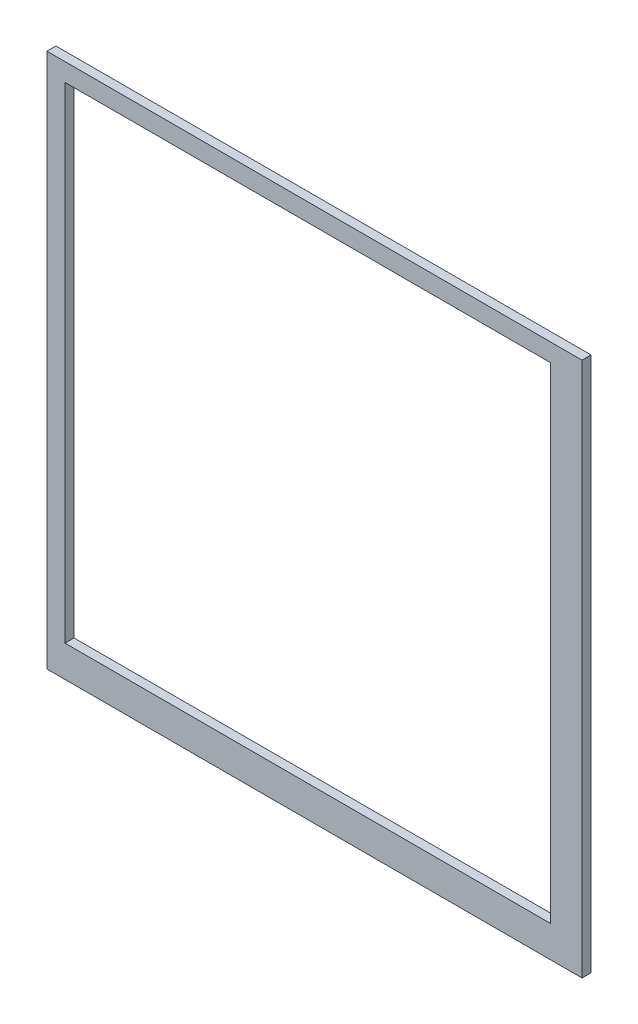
ISO-10303-21;
HEADER;
FILE_DESCRIPTION(('STEP AP214'),'2;1');
FILE_NAME('part.step','',(''),(''),'','','');
FILE_SCHEMA(('AUTOMOTIVE_DESIGN { 1 0 10303 214 1 1 1 1 }'));
ENDSEC;
DATA;
#1=APPLICATION_CONTEXT('core data for automotive mechanical design processes');
#2=APPLICATION_PROTOCOL_DEFINITION('international standard','automotive_design',2000,#1);
#3=PRODUCT_CONTEXT('',#1,'mechanical');
#4=PRODUCT('Part','Part','',(#3));
#5=PRODUCT_RELATED_PRODUCT_CATEGORY('part','',(#4));
#6=PRODUCT_DEFINITION_FORMATION('','',#4);
#7=PRODUCT_DEFINITION_CONTEXT('part definition',#1,'design');
#8=PRODUCT_DEFINITION('design','',#6,#7);
#9=PRODUCT_DEFINITION_SHAPE('','',#8);
#10=(LENGTH_UNIT() NAMED_UNIT(*) SI_UNIT(.MILLI.,.METRE.));
#11=(NAMED_UNIT(*) PLANE_ANGLE_UNIT() SI_UNIT($,.RADIAN.));
#12=(NAMED_UNIT(*) SI_UNIT($,.STERADIAN.) SOLID_ANGLE_UNIT());
#13=UNCERTAINTY_MEASURE_WITH_UNIT(LENGTH_MEASURE(1.E-05),#10,'distance_accuracy_value','');
#14=(GEOMETRIC_REPRESENTATION_CONTEXT(3) GLOBAL_UNCERTAINTY_ASSIGNED_CONTEXT((#13)) GLOBAL_UNIT_ASSIGNED_CONTEXT((#10,
#11,#12)) REPRESENTATION_CONTEXT('',''));
#15=CARTESIAN_POINT('',(0.,0.,0.));
#16=DIRECTION('',(0.,0.,1.));
#17=DIRECTION('',(1.,0.,0.));
#18=AXIS2_PLACEMENT_3D('',#15,#16,#17);
#19=CARTESIAN_POINT('',(0.,0.,10.));
#20=DIRECTION('',(0.,0.,1.));
#21=DIRECTION('',(1.,0.,0.));
#22=AXIS2_PLACEMENT_3D('',#19,#20,#21);
#23=PLANE('',#22);
#24=DIRECTION('',(0.,-1.,0.));
#25=VECTOR('',#24,1.);
#26=CARTESIAN_POINT('',(305.,-305.,10.));
#27=LINE('',#26,#25);
#28=CARTESIAN_POINT('',(305.,290.,10.));
#29=VERTEX_POINT('',#28);
#30=CARTESIAN_POINT('',(305.,-305.,10.));
#31=VERTEX_POINT('',#30);
#32=EDGE_CURVE('E115',#29,#31,#27,.T.);
#33=ORIENTED_EDGE('',*,*,#32,.F.);
#34=DIRECTION('',(-1.,0.,0.));
#35=VECTOR('',#34,1.);
#36=CARTESIAN_POINT('',(290.,290.,10.));
#37=LINE('',#36,#35);
#38=CARTESIAN_POINT('',(-290.,290.,10.));
#39=VERTEX_POINT('',#38);
#40=EDGE_CURVE('E156',#29,#39,#37,.T.);
#41=ORIENTED_EDGE('',*,*,#40,.T.);
#42=DIRECTION('',(0.,-1.,0.));
#43=VECTOR('',#42,1.);
#44=CARTESIAN_POINT('',(-290.,-290.,10.));
#45=LINE('',#44,#43);
#46=CARTESIAN_POINT('',(-290.,-305.,10.));
#47=VERTEX_POINT('',#46);
#48=EDGE_CURVE('E40',#39,#47,#45,.T.);
#49=ORIENTED_EDGE('',*,*,#48,.T.);
#50=DIRECTION('',(-1.,0.,0.));
#51=VECTOR('',#50,1.);
#52=CARTESIAN_POINT('',(-290.,-305.,10.));
#53=LINE('',#52,#51);
#54=EDGE_CURVE('E103',#31,#47,#53,.T.);
#55=ORIENTED_EDGE('',*,*,#54,.F.);
#56=EDGE_LOOP('',(#33,#41,#49,#55));
#57=FACE_BOUND('',#56,.T.);
#58=DIRECTION('',(1.,0.,0.));
#59=VECTOR('',#58,1.);
#60=CARTESIAN_POINT('',(270.,-270.,10.));
#61=LINE('',#60,#59);
#62=CARTESIAN_POINT('',(-270.,-270.,10.));
#63=VERTEX_POINT('',#62);
#64=CARTESIAN_POINT('',(270.,-270.,10.));
#65=VERTEX_POINT('',#64);
#66=EDGE_CURVE('E132',#63,#65,#61,.T.);
#67=ORIENTED_EDGE('',*,*,#66,.F.);
#68=DIRECTION('',(0.,-1.,0.));
#69=VECTOR('',#68,1.);
#70=CARTESIAN_POINT('',(-270.,-270.,10.));
#71=LINE('',#70,#69);
#72=CARTESIAN_POINT('',(-270.,270.,10.));
#73=VERTEX_POINT('',#72);
#74=EDGE_CURVE('E130',#73,#63,#71,.T.);
#75=ORIENTED_EDGE('',*,*,#74,.F.);
#76=DIRECTION('',(-1.,0.,0.));
#77=VECTOR('',#76,1.);
#78=CARTESIAN_POINT('',(270.,270.,10.));
#79=LINE('',#78,#77);
#80=CARTESIAN_POINT('',(270.,270.,10.));
#81=VERTEX_POINT('',#80);
#82=EDGE_CURVE('E137',#81,#73,#79,.T.);
#83=ORIENTED_EDGE('',*,*,#82,.F.);
#84=DIRECTION('',(0.,1.,0.));
#85=VECTOR('',#84,1.);
#86=CARTESIAN_POINT('',(270.,-270.,10.));
#87=LINE('',#86,#85);
#88=EDGE_CURVE('E135',#65,#81,#87,.T.);
#89=ORIENTED_EDGE('',*,*,#88,.F.);
#90=EDGE_LOOP('',(#67,#75,#83,#89));
#91=FACE_BOUND('',#90,.T.);
#92=ADVANCED_FACE('F32',(#57,#91),#23,.T.);
#93=CARTESIAN_POINT('',(0.,0.,0.));
#94=DIRECTION('',(0.,0.,1.));
#95=DIRECTION('',(1.,0.,0.));
#96=AXIS2_PLACEMENT_3D('',#93,#94,#95);
#97=PLANE('',#96);
#98=DIRECTION('',(-1.,0.,0.));
#99=VECTOR('',#98,1.);
#100=CARTESIAN_POINT('',(290.,290.,0.));
#101=LINE('',#100,#99);
#102=CARTESIAN_POINT('',(305.,290.,0.));
#103=VERTEX_POINT('',#102);
#104=CARTESIAN_POINT('',(-290.,290.,0.));
#105=VERTEX_POINT('',#104);
#106=EDGE_CURVE('E155',#103,#105,#101,.T.);
#107=ORIENTED_EDGE('',*,*,#106,.F.);
#108=DIRECTION('',(0.,-1.,0.));
#109=VECTOR('',#108,1.);
#110=CARTESIAN_POINT('',(305.,-305.,0.));
#111=LINE('',#110,#109);
#112=CARTESIAN_POINT('',(305.,-305.,0.));
#113=VERTEX_POINT('',#112);
#114=EDGE_CURVE('E124',#103,#113,#111,.T.);
#115=ORIENTED_EDGE('',*,*,#114,.T.);
#116=DIRECTION('',(-1.,0.,0.));
#117=VECTOR('',#116,1.);
#118=CARTESIAN_POINT('',(-290.,-305.,0.));
#119=LINE('',#118,#117);
#120=CARTESIAN_POINT('',(-290.,-305.,0.));
#121=VERTEX_POINT('',#120);
#122=EDGE_CURVE('E105',#113,#121,#119,.T.);
#123=ORIENTED_EDGE('',*,*,#122,.T.);
#124=DIRECTION('',(0.,-1.,0.));
#125=VECTOR('',#124,1.);
#126=CARTESIAN_POINT('',(-290.,-290.,0.));
#127=LINE('',#126,#125);
#128=EDGE_CURVE('E158',#105,#121,#127,.T.);
#129=ORIENTED_EDGE('',*,*,#128,.F.);
#130=EDGE_LOOP('',(#107,#115,#123,#129));
#131=FACE_BOUND('',#130,.T.);
#132=DIRECTION('',(0.,-1.,0.));
#133=VECTOR('',#132,1.);
#134=CARTESIAN_POINT('',(-270.,-270.,0.));
#135=LINE('',#134,#133);
#136=CARTESIAN_POINT('',(-270.,270.,0.));
#137=VERTEX_POINT('',#136);
#138=CARTESIAN_POINT('',(-270.,-270.,0.));
#139=VERTEX_POINT('',#138);
#140=EDGE_CURVE('E55',#137,#139,#135,.T.);
#141=ORIENTED_EDGE('',*,*,#140,.T.);
#142=DIRECTION('',(1.,0.,0.));
#143=VECTOR('',#142,1.);
#144=CARTESIAN_POINT('',(270.,-270.,0.));
#145=LINE('',#144,#143);
#146=CARTESIAN_POINT('',(270.,-270.,0.));
#147=VERTEX_POINT('',#146);
#148=EDGE_CURVE('E141',#139,#147,#145,.T.);
#149=ORIENTED_EDGE('',*,*,#148,.T.);
#150=DIRECTION('',(0.,1.,0.));
#151=VECTOR('',#150,1.);
#152=CARTESIAN_POINT('',(270.,-270.,0.));
#153=LINE('',#152,#151);
#154=CARTESIAN_POINT('',(270.,270.,0.));
#155=VERTEX_POINT('',#154);
#156=EDGE_CURVE('E144',#147,#155,#153,.T.);
#157=ORIENTED_EDGE('',*,*,#156,.T.);
#158=DIRECTION('',(-1.,0.,0.));
#159=VECTOR('',#158,1.);
#160=CARTESIAN_POINT('',(270.,270.,0.));
#161=LINE('',#160,#159);
#162=EDGE_CURVE('E133',#155,#137,#161,.T.);
#163=ORIENTED_EDGE('',*,*,#162,.T.);
#164=EDGE_LOOP('',(#141,#149,#157,#163));
#165=FACE_BOUND('',#164,.T.);
#166=ADVANCED_FACE('F165',(#131,#165),#97,.F.);
#167=CARTESIAN_POINT('',(290.,290.,10.));
#168=DIRECTION('',(0.,-1.,0.));
#169=DIRECTION('',(1.,0.,0.));
#170=AXIS2_PLACEMENT_3D('',#167,#168,#169);
#171=PLANE('',#170);
#172=ORIENTED_EDGE('',*,*,#106,.T.);
#173=DIRECTION('',(0.,0.,-1.));
#174=VECTOR('',#173,1.);
#175=CARTESIAN_POINT('',(-290.,290.,10.));
#176=LINE('',#175,#174);
#177=EDGE_CURVE('E11',#39,#105,#176,.T.);
#178=ORIENTED_EDGE('',*,*,#177,.F.);
#179=ORIENTED_EDGE('',*,*,#40,.F.);
#180=DIRECTION('',(0.,0.,-1.));
#181=VECTOR('',#180,1.);
#182=CARTESIAN_POINT('',(305.,290.,10.));
#183=LINE('',#182,#181);
#184=EDGE_CURVE('E122',#29,#103,#183,.T.);
#185=ORIENTED_EDGE('',*,*,#184,.T.);
#186=EDGE_LOOP('',(#172,#178,#179,#185));
#187=FACE_BOUND('',#186,.T.);
#188=ADVANCED_FACE('F34',(#187),#171,.F.);
#189=CARTESIAN_POINT('',(-290.,-290.,10.));
#190=DIRECTION('',(1.,0.,0.));
#191=DIRECTION('',(0.,0.,-1.));
#192=AXIS2_PLACEMENT_3D('',#189,#190,#191);
#193=PLANE('',#192);
#194=ORIENTED_EDGE('',*,*,#128,.T.);
#195=DIRECTION('',(0.,0.,-1.));
#196=VECTOR('',#195,1.);
#197=CARTESIAN_POINT('',(-290.,-305.,10.));
#198=LINE('',#197,#196);
#199=EDGE_CURVE('E110',#47,#121,#198,.T.);
#200=ORIENTED_EDGE('',*,*,#199,.F.);
#201=ORIENTED_EDGE('',*,*,#48,.F.);
#202=ORIENTED_EDGE('',*,*,#177,.T.);
#203=EDGE_LOOP('',(#194,#200,#201,#202));
#204=FACE_BOUND('',#203,.T.);
#205=ADVANCED_FACE('F162',(#204),#193,.F.);
#206=CARTESIAN_POINT('',(-270.,-270.,10.));
#207=DIRECTION('',(1.,0.,0.));
#208=DIRECTION('',(0.,0.,-1.));
#209=AXIS2_PLACEMENT_3D('',#206,#207,#208);
#210=PLANE('',#209);
#211=ORIENTED_EDGE('',*,*,#140,.F.);
#212=DIRECTION('',(0.,0.,-1.));
#213=VECTOR('',#212,1.);
#214=CARTESIAN_POINT('',(-270.,270.,10.));
#215=LINE('',#214,#213);
#216=EDGE_CURVE('E139',#73,#137,#215,.T.);
#217=ORIENTED_EDGE('',*,*,#216,.F.);
#218=ORIENTED_EDGE('',*,*,#74,.T.);
#219=DIRECTION('',(0.,0.,-1.));
#220=VECTOR('',#219,1.);
#221=CARTESIAN_POINT('',(-270.,-270.,10.));
#222=LINE('',#221,#220);
#223=EDGE_CURVE('E153',#63,#139,#222,.T.);
#224=ORIENTED_EDGE('',*,*,#223,.T.);
#225=EDGE_LOOP('',(#211,#217,#218,#224));
#226=FACE_BOUND('',#225,.T.);
#227=ADVANCED_FACE('F173',(#226),#210,.T.);
#228=CARTESIAN_POINT('',(270.,-270.,10.));
#229=DIRECTION('',(0.,1.,0.));
#230=DIRECTION('',(-1.,0.,0.));
#231=AXIS2_PLACEMENT_3D('',#228,#229,#230);
#232=PLANE('',#231);
#233=ORIENTED_EDGE('',*,*,#148,.F.);
#234=ORIENTED_EDGE('',*,*,#223,.F.);
#235=ORIENTED_EDGE('',*,*,#66,.T.);
#236=DIRECTION('',(0.,0.,-1.));
#237=VECTOR('',#236,1.);
#238=CARTESIAN_POINT('',(270.,-270.,10.));
#239=LINE('',#238,#237);
#240=EDGE_CURVE('E151',#65,#147,#239,.T.);
#241=ORIENTED_EDGE('',*,*,#240,.T.);
#242=EDGE_LOOP('',(#233,#234,#235,#241));
#243=FACE_BOUND('',#242,.T.);
#244=ADVANCED_FACE('F182',(#243),#232,.T.);
#245=CARTESIAN_POINT('',(270.,-270.,10.));
#246=DIRECTION('',(-1.,0.,0.));
#247=DIRECTION('',(0.,0.,1.));
#248=AXIS2_PLACEMENT_3D('',#245,#246,#247);
#249=PLANE('',#248);
#250=ORIENTED_EDGE('',*,*,#156,.F.);
#251=ORIENTED_EDGE('',*,*,#240,.F.);
#252=ORIENTED_EDGE('',*,*,#88,.T.);
#253=DIRECTION('',(0.,0.,-1.));
#254=VECTOR('',#253,1.);
#255=CARTESIAN_POINT('',(270.,270.,10.));
#256=LINE('',#255,#254);
#257=EDGE_CURVE('E47',#81,#155,#256,.T.);
#258=ORIENTED_EDGE('',*,*,#257,.T.);
#259=EDGE_LOOP('',(#250,#251,#252,#258));
#260=FACE_BOUND('',#259,.T.);
#261=ADVANCED_FACE('F185',(#260),#249,.T.);
#262=CARTESIAN_POINT('',(270.,270.,10.));
#263=DIRECTION('',(0.,-1.,0.));
#264=DIRECTION('',(1.,0.,0.));
#265=AXIS2_PLACEMENT_3D('',#262,#263,#264);
#266=PLANE('',#265);
#267=ORIENTED_EDGE('',*,*,#162,.F.);
#268=ORIENTED_EDGE('',*,*,#257,.F.);
#269=ORIENTED_EDGE('',*,*,#82,.T.);
#270=ORIENTED_EDGE('',*,*,#216,.T.);
#271=EDGE_LOOP('',(#267,#268,#269,#270));
#272=FACE_BOUND('',#271,.T.);
#273=ADVANCED_FACE('F189',(#272),#266,.T.);
#274=CARTESIAN_POINT('',(305.,-305.,10.));
#275=DIRECTION('',(1.,0.,0.));
#276=DIRECTION('',(0.,0.,-1.));
#277=AXIS2_PLACEMENT_3D('',#274,#275,#276);
#278=PLANE('',#277);
#279=ORIENTED_EDGE('',*,*,#114,.F.);
#280=ORIENTED_EDGE('',*,*,#184,.F.);
#281=ORIENTED_EDGE('',*,*,#32,.T.);
#282=DIRECTION('',(0.,0.,-1.));
#283=VECTOR('',#282,1.);
#284=CARTESIAN_POINT('',(305.,-305.,10.));
#285=LINE('',#284,#283);
#286=EDGE_CURVE('E99',#31,#113,#285,.T.);
#287=ORIENTED_EDGE('',*,*,#286,.T.);
#288=EDGE_LOOP('',(#279,#280,#281,#287));
#289=FACE_BOUND('',#288,.T.);
#290=ADVANCED_FACE('F120',(#289),#278,.T.);
#291=CARTESIAN_POINT('',(-290.,-305.,10.));
#292=DIRECTION('',(0.,-1.,0.));
#293=DIRECTION('',(1.,0.,0.));
#294=AXIS2_PLACEMENT_3D('',#291,#292,#293);
#295=PLANE('',#294);
#296=ORIENTED_EDGE('',*,*,#122,.F.);
#297=ORIENTED_EDGE('',*,*,#286,.F.);
#298=ORIENTED_EDGE('',*,*,#54,.T.);
#299=ORIENTED_EDGE('',*,*,#199,.T.);
#300=EDGE_LOOP('',(#296,#297,#298,#299));
#301=FACE_BOUND('',#300,.T.);
#302=ADVANCED_FACE('F101',(#301),#295,.T.);
#303=CLOSED_SHELL('',(#92,#166,#188,#205,#227,#244,#261,#273,#290,#302));
#304=MANIFOLD_SOLID_BREP('B2',#303);
#305=ADVANCED_BREP_SHAPE_REPRESENTATION('',(#18,#304),#14);
#306=SHAPE_DEFINITION_REPRESENTATION(#9,#305);
ENDSEC;
END-ISO-10303-21;
